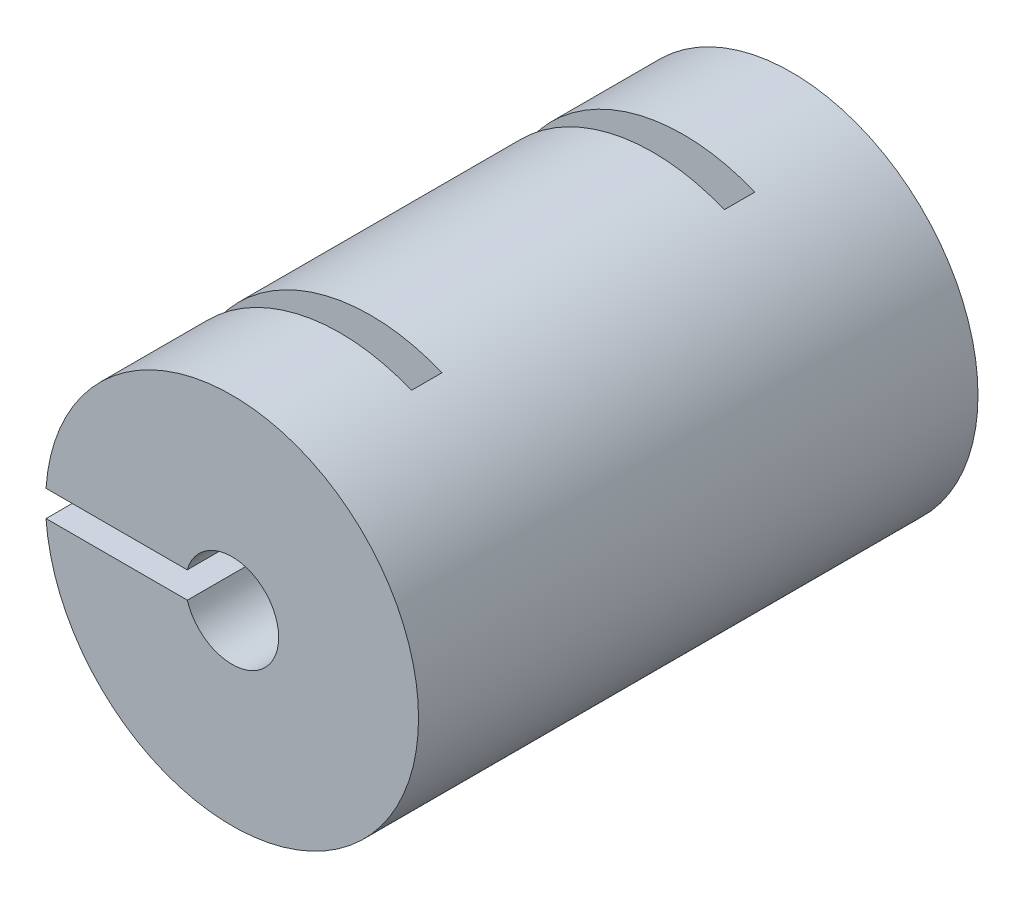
from build123d import *

# Parameters (mm, degrees)
SKETCH1_R          = 6.35
SKETCH1_R_2        = 1.5875
EXTRUDE1_DEPTH     = 9.525
SKETCH2_W          = 8.564862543
SKETCH2_H          = 0.891036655
CUT_EXTRUDE1_DEPTH = 5.08
SKETCH3_W          = 13.504046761
SKETCH3_H          = 1.038772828
CUT_EXTRUDE2_DEPTH = 14.090860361


with BuildPart() as part:
    # Sketch1 → Extrude1 (new, symmetric)
    with BuildSketch(Plane.XY):
        with Locations(Location((0, 0, 0), (0, 0, 180))):
            Circle(SKETCH1_R)
        with Locations(Location((0, 0, 0), (0, 0, 180))):
            Circle(SKETCH1_R_2, mode=Mode.SUBTRACT)
    extrude(amount=EXTRUDE1_DEPTH, both=True)

    # Sketch2 → Cut-Extrude1 (cut)
    with BuildSketch(Plane.XY.offset(9.525)):
        with Locations((-4.018757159, -0.009092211)):
            Rectangle(SKETCH2_W, SKETCH2_H)
    cut_extrude1 = extrude(amount=-CUT_EXTRUDE1_DEPTH, mode=Mode.SUBTRACT)

    # Sketch3 → Cut-Extrude2 (cut, symmetric)
    with BuildSketch(Plane(origin=(0, 0, 0), x_dir=(1, 0, 0), z_dir=(0, 1, 0))):
        with Locations((-4.323018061, -5.326262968)):
            Rectangle(SKETCH3_W, SKETCH3_H)
    cut_extrude2 = extrude(amount=CUT_EXTRUDE2_DEPTH, both=True, mode=Mode.SUBTRACT)

    # Mirror1: Cut-Extrude1, Cut-Extrude2 across plane
    add(cut_extrude1.mirror(Plane.XY), mode=Mode.SUBTRACT)
    add(cut_extrude2.mirror(Plane.XY), mode=Mode.SUBTRACT)


solid = part.part
